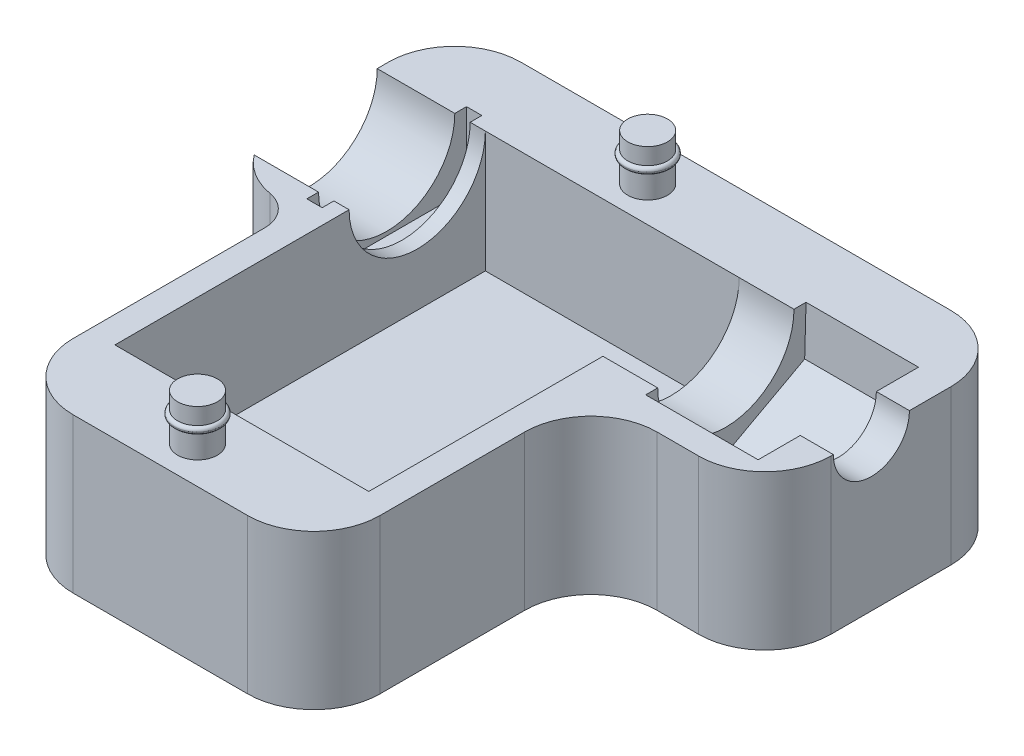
ISO-10303-21;
HEADER;
FILE_DESCRIPTION(('STEP AP214'),'2;1');
FILE_NAME('part.step','',(''),(''),'','','');
FILE_SCHEMA(('AUTOMOTIVE_DESIGN { 1 0 10303 214 1 1 1 1 }'));
ENDSEC;
DATA;
#1=APPLICATION_CONTEXT('core data for automotive mechanical design processes');
#2=APPLICATION_PROTOCOL_DEFINITION('international standard','automotive_design',2000,#1);
#3=PRODUCT_CONTEXT('',#1,'mechanical');
#4=PRODUCT('Part','Part','',(#3));
#5=PRODUCT_RELATED_PRODUCT_CATEGORY('part','',(#4));
#6=PRODUCT_DEFINITION_FORMATION('','',#4);
#7=PRODUCT_DEFINITION_CONTEXT('part definition',#1,'design');
#8=PRODUCT_DEFINITION('design','',#6,#7);
#9=PRODUCT_DEFINITION_SHAPE('','',#8);
#10=(LENGTH_UNIT() NAMED_UNIT(*) SI_UNIT(.MILLI.,.METRE.));
#11=(NAMED_UNIT(*) PLANE_ANGLE_UNIT() SI_UNIT($,.RADIAN.));
#12=(NAMED_UNIT(*) SI_UNIT($,.STERADIAN.) SOLID_ANGLE_UNIT());
#13=UNCERTAINTY_MEASURE_WITH_UNIT(LENGTH_MEASURE(1.E-05),#10,'distance_accuracy_value','');
#14=(GEOMETRIC_REPRESENTATION_CONTEXT(3) GLOBAL_UNCERTAINTY_ASSIGNED_CONTEXT((#13)) GLOBAL_UNIT_ASSIGNED_CONTEXT((#10,
#11,#12)) REPRESENTATION_CONTEXT('',''));
#15=CARTESIAN_POINT('',(0.,0.,0.));
#16=DIRECTION('',(0.,0.,1.));
#17=DIRECTION('',(1.,0.,0.));
#18=AXIS2_PLACEMENT_3D('',#15,#16,#17);
#19=CARTESIAN_POINT('',(-6.96499999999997,40.35,34.4));
#20=DIRECTION('',(0.,-1.,0.));
#21=DIRECTION('',(0.,0.,-1.));
#22=AXIS2_PLACEMENT_3D('',#19,#20,#21);
#23=CYLINDRICAL_SURFACE('',#22,3.);
#24=CARTESIAN_POINT('',(-6.96499999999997,33.35,34.4));
#25=DIRECTION('',(0.,-1.,0.));
#26=DIRECTION('',(0.,0.,-1.));
#27=AXIS2_PLACEMENT_3D('',#24,#25,#26);
#28=CIRCLE('',#27,3.);
#29=CARTESIAN_POINT('',(-6.96499999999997,33.35,31.4));
#30=VERTEX_POINT('',#29);
#31=EDGE_CURVE('E233',#30,#30,#28,.F.);
#32=ORIENTED_EDGE('',*,*,#31,.T.);
#33=EDGE_LOOP('',(#32));
#34=FACE_BOUND('',#33,.T.);
#35=CARTESIAN_POINT('',(-6.96499999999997,36.85,34.4));
#36=DIRECTION('',(0.,1.,0.));
#37=DIRECTION('',(0.,0.,1.));
#38=AXIS2_PLACEMENT_3D('',#35,#36,#37);
#39=CIRCLE('',#38,3.);
#40=CARTESIAN_POINT('',(-6.96499999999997,36.85,37.4));
#41=VERTEX_POINT('',#40);
#42=EDGE_CURVE('E12',#41,#41,#39,.T.);
#43=ORIENTED_EDGE('',*,*,#42,.F.);
#44=EDGE_LOOP('',(#43));
#45=FACE_BOUND('',#44,.T.);
#46=ADVANCED_FACE('F224',(#34,#45),#23,.T.);
#47=CARTESIAN_POINT('',(-6.96499999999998,40.35,-33.65));
#48=DIRECTION('',(0.,-1.,0.));
#49=DIRECTION('',(0.,0.,-1.));
#50=AXIS2_PLACEMENT_3D('',#47,#48,#49);
#51=CYLINDRICAL_SURFACE('',#50,3.);
#52=CARTESIAN_POINT('',(-6.96499999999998,33.35,-33.65));
#53=DIRECTION('',(0.,-1.,0.));
#54=DIRECTION('',(0.,0.,-1.));
#55=AXIS2_PLACEMENT_3D('',#52,#53,#54);
#56=CIRCLE('',#55,3.);
#57=CARTESIAN_POINT('',(-6.96499999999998,33.35,-36.65));
#58=VERTEX_POINT('',#57);
#59=EDGE_CURVE('E512',#58,#58,#56,.F.);
#60=ORIENTED_EDGE('',*,*,#59,.T.);
#61=EDGE_LOOP('',(#60));
#62=FACE_BOUND('',#61,.T.);
#63=CARTESIAN_POINT('',(-6.96499999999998,36.85,-33.65));
#64=DIRECTION('',(0.,1.,0.));
#65=DIRECTION('',(0.,0.,1.));
#66=AXIS2_PLACEMENT_3D('',#63,#64,#65);
#67=CIRCLE('',#66,3.);
#68=CARTESIAN_POINT('',(-6.96499999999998,36.85,-30.65));
#69=VERTEX_POINT('',#68);
#70=EDGE_CURVE('E515',#69,#69,#67,.T.);
#71=ORIENTED_EDGE('',*,*,#70,.F.);
#72=EDGE_LOOP('',(#71));
#73=FACE_BOUND('',#72,.T.);
#74=ADVANCED_FACE('F856',(#62,#73),#51,.T.);
#75=CARTESIAN_POINT('',(42.5,33.35,40.));
#76=DIRECTION('',(-1.,0.,0.));
#77=DIRECTION('',(0.,0.,1.));
#78=AXIS2_PLACEMENT_3D('',#75,#76,#77);
#79=PLANE('',#78);
#80=DIRECTION('',(0.,0.,-1.));
#81=VECTOR('',#80,1.);
#82=CARTESIAN_POINT('',(42.5,10.,45.));
#83=LINE('',#82,#81);
#84=CARTESIAN_POINT('',(42.5,10.,-11.8801725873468));
#85=VERTEX_POINT('',#84);
#86=CARTESIAN_POINT('',(42.5,10.,-30.));
#87=VERTEX_POINT('',#86);
#88=EDGE_CURVE('E452',#85,#87,#83,.T.);
#89=ORIENTED_EDGE('',*,*,#88,.T.);
#90=DIRECTION('',(0.,-1.,0.));
#91=VECTOR('',#90,1.);
#92=CARTESIAN_POINT('',(42.5,33.35,-30.));
#93=LINE('',#92,#91);
#94=CARTESIAN_POINT('',(42.5,33.35,-30.));
#95=VERTEX_POINT('',#94);
#96=EDGE_CURVE('E478',#87,#95,#93,.F.);
#97=ORIENTED_EDGE('',*,*,#96,.T.);
#98=DIRECTION('',(0.,0.,-1.));
#99=VECTOR('',#98,1.);
#100=CARTESIAN_POINT('',(42.5,33.35,40.));
#101=LINE('',#100,#99);
#102=CARTESIAN_POINT('',(42.5,33.35,-23.75));
#103=VERTEX_POINT('',#102);
#104=EDGE_CURVE('E574',#103,#95,#101,.T.);
#105=ORIENTED_EDGE('',*,*,#104,.F.);
#106=CARTESIAN_POINT('',(42.5,33.35,-18.));
#107=DIRECTION('',(1.,0.,0.));
#108=DIRECTION('',(0.,0.,-1.));
#109=AXIS2_PLACEMENT_3D('',#106,#107,#108);
#110=CIRCLE('',#109,5.74999999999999);
#111=CARTESIAN_POINT('',(42.5,33.35,-12.25));
#112=VERTEX_POINT('',#111);
#113=EDGE_CURVE('E712',#112,#103,#110,.T.);
#114=ORIENTED_EDGE('',*,*,#113,.F.);
#115=CARTESIAN_POINT('',(42.5,33.35,-11.8801725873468));
#116=VERTEX_POINT('',#115);
#117=EDGE_CURVE('E477',#116,#112,#101,.T.);
#118=ORIENTED_EDGE('',*,*,#117,.F.);
#119=DIRECTION('',(0.,1.,0.));
#120=VECTOR('',#119,1.);
#121=CARTESIAN_POINT('',(42.5,0.,-11.8801725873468));
#122=LINE('',#121,#120);
#123=EDGE_CURVE('E470',#116,#85,#122,.F.);
#124=ORIENTED_EDGE('',*,*,#123,.T.);
#125=EDGE_LOOP('',(#89,#97,#105,#114,#118,#124));
#126=FACE_BOUND('',#125,.T.);
#127=ADVANCED_FACE('F475',(#126),#79,.F.);
#128=CARTESIAN_POINT('',(-42.5,33.35,-40.));
#129=DIRECTION('',(0.,0.,1.));
#130=DIRECTION('',(1.,0.,0.));
#131=AXIS2_PLACEMENT_3D('',#128,#129,#130);
#132=PLANE('',#131);
#133=DIRECTION('',(1.,0.,0.));
#134=VECTOR('',#133,1.);
#135=CARTESIAN_POINT('',(-42.5,10.,-40.));
#136=LINE('',#135,#134);
#137=CARTESIAN_POINT('',(-32.5,10.,-40.));
#138=VERTEX_POINT('',#137);
#139=CARTESIAN_POINT('',(32.5,10.,-40.));
#140=VERTEX_POINT('',#139);
#141=EDGE_CURVE('E584',#138,#140,#136,.T.);
#142=ORIENTED_EDGE('',*,*,#141,.F.);
#143=DIRECTION('',(0.,-1.,0.));
#144=VECTOR('',#143,1.);
#145=CARTESIAN_POINT('',(-32.5,33.35,-40.));
#146=LINE('',#145,#144);
#147=CARTESIAN_POINT('',(-32.5,33.35,-40.));
#148=VERTEX_POINT('',#147);
#149=EDGE_CURVE('E559',#138,#148,#146,.F.);
#150=ORIENTED_EDGE('',*,*,#149,.T.);
#151=DIRECTION('',(-1.,0.,0.));
#152=VECTOR('',#151,1.);
#153=CARTESIAN_POINT('',(-42.5,33.35,-40.));
#154=LINE('',#153,#152);
#155=CARTESIAN_POINT('',(32.5,33.35,-40.));
#156=VERTEX_POINT('',#155);
#157=EDGE_CURVE('E570',#156,#148,#154,.T.);
#158=ORIENTED_EDGE('',*,*,#157,.F.);
#159=DIRECTION('',(0.,-1.,0.));
#160=VECTOR('',#159,1.);
#161=CARTESIAN_POINT('',(32.5,33.35,-40.));
#162=LINE('',#161,#160);
#163=EDGE_CURVE('E555',#156,#140,#162,.T.);
#164=ORIENTED_EDGE('',*,*,#163,.T.);
#165=EDGE_LOOP('',(#142,#150,#158,#164));
#166=FACE_BOUND('',#165,.T.);
#167=ADVANCED_FACE('F579',(#166),#132,.F.);
#168=CARTESIAN_POINT('',(-42.5,33.35,40.));
#169=DIRECTION('',(1.,0.,0.));
#170=DIRECTION('',(0.,0.,-1.));
#171=AXIS2_PLACEMENT_3D('',#168,#169,#170);
#172=PLANE('',#171);
#173=DIRECTION('',(0.,0.,-1.));
#174=VECTOR('',#173,1.);
#175=CARTESIAN_POINT('',(-42.5,10.,45.));
#176=LINE('',#175,#174);
#177=CARTESIAN_POINT('',(-42.5,10.,-13.7));
#178=VERTEX_POINT('',#177);
#179=CARTESIAN_POINT('',(-42.5,10.,-30.));
#180=VERTEX_POINT('',#179);
#181=EDGE_CURVE('E462',#178,#180,#176,.T.);
#182=ORIENTED_EDGE('',*,*,#181,.F.);
#183=DIRECTION('',(0.,1.,0.));
#184=VECTOR('',#183,1.);
#185=CARTESIAN_POINT('',(-42.5,33.35,-13.7));
#186=LINE('',#185,#184);
#187=CARTESIAN_POINT('',(-42.5,23.9905128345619,-13.7));
#188=VERTEX_POINT('',#187);
#189=EDGE_CURVE('E752',#178,#188,#186,.T.);
#190=ORIENTED_EDGE('',*,*,#189,.T.);
#191=CARTESIAN_POINT('',(-42.5,33.35,-18.));
#192=DIRECTION('',(1.,0.,0.));
#193=DIRECTION('',(0.,0.,-1.));
#194=AXIS2_PLACEMENT_3D('',#191,#192,#193);
#195=CIRCLE('',#194,10.3);
#196=CARTESIAN_POINT('',(-42.5,33.35,-28.3));
#197=VERTEX_POINT('',#196);
#198=EDGE_CURVE('E545',#188,#197,#195,.T.);
#199=ORIENTED_EDGE('',*,*,#198,.T.);
#200=DIRECTION('',(0.,0.,1.));
#201=VECTOR('',#200,1.);
#202=CARTESIAN_POINT('',(-42.5,33.35,40.));
#203=LINE('',#202,#201);
#204=CARTESIAN_POINT('',(-42.5,33.35,-30.));
#205=VERTEX_POINT('',#204);
#206=EDGE_CURVE('E581',#205,#197,#203,.T.);
#207=ORIENTED_EDGE('',*,*,#206,.F.);
#208=DIRECTION('',(0.,-1.,0.));
#209=VECTOR('',#208,1.);
#210=CARTESIAN_POINT('',(-42.5,33.35,-30.));
#211=LINE('',#210,#209);
#212=EDGE_CURVE('E749',#205,#180,#211,.T.);
#213=ORIENTED_EDGE('',*,*,#212,.T.);
#214=EDGE_LOOP('',(#182,#190,#199,#207,#213));
#215=FACE_BOUND('',#214,.T.);
#216=ADVANCED_FACE('F849',(#215),#172,.F.);
#217=CARTESIAN_POINT('',(-42.5,33.35,40.));
#218=DIRECTION('',(0.,0.,-1.));
#219=DIRECTION('',(-1.,0.,0.));
#220=AXIS2_PLACEMENT_3D('',#217,#218,#219);
#221=PLANE('',#220);
#222=DIRECTION('',(-1.,0.,0.));
#223=VECTOR('',#222,1.);
#224=CARTESIAN_POINT('',(-42.5,10.,40.));
#225=LINE('',#224,#223);
#226=CARTESIAN_POINT('',(6.22000000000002,10.,40.));
#227=VERTEX_POINT('',#226);
#228=CARTESIAN_POINT('',(-20.15,10.,40.));
#229=VERTEX_POINT('',#228);
#230=EDGE_CURVE('E899',#227,#229,#225,.T.);
#231=ORIENTED_EDGE('',*,*,#230,.F.);
#232=DIRECTION('',(0.,1.,0.));
#233=VECTOR('',#232,1.);
#234=CARTESIAN_POINT('',(6.22000000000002,33.35,40.));
#235=LINE('',#234,#233);
#236=CARTESIAN_POINT('',(6.22000000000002,33.35,40.));
#237=VERTEX_POINT('',#236);
#238=EDGE_CURVE('E498',#227,#237,#235,.T.);
#239=ORIENTED_EDGE('',*,*,#238,.T.);
#240=DIRECTION('',(1.,0.,0.));
#241=VECTOR('',#240,1.);
#242=CARTESIAN_POINT('',(-42.5,33.35,40.));
#243=LINE('',#242,#241);
#244=CARTESIAN_POINT('',(-20.15,33.35,40.));
#245=VERTEX_POINT('',#244);
#246=EDGE_CURVE('E716',#245,#237,#243,.T.);
#247=ORIENTED_EDGE('',*,*,#246,.F.);
#248=DIRECTION('',(0.,1.,0.));
#249=VECTOR('',#248,1.);
#250=CARTESIAN_POINT('',(-20.15,33.35,40.));
#251=LINE('',#250,#249);
#252=EDGE_CURVE('E495',#245,#229,#251,.F.);
#253=ORIENTED_EDGE('',*,*,#252,.T.);
#254=EDGE_LOOP('',(#231,#239,#247,#253));
#255=FACE_BOUND('',#254,.T.);
#256=ADVANCED_FACE('F846',(#255),#221,.F.);
#257=CARTESIAN_POINT('',(16.22,0.,-1.88017258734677));
#258=DIRECTION('',(-1.,0.,0.));
#259=DIRECTION('',(0.,0.,1.));
#260=AXIS2_PLACEMENT_3D('',#257,#258,#259);
#261=PLANE('',#260);
#262=DIRECTION('',(0.,0.,1.));
#263=VECTOR('',#262,1.);
#264=CARTESIAN_POINT('',(16.22,10.,-1.88017258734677));
#265=LINE('',#264,#263);
#266=CARTESIAN_POINT('',(16.22,10.,8.11982741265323));
#267=VERTEX_POINT('',#266);
#268=CARTESIAN_POINT('',(16.22,10.,30.));
#269=VERTEX_POINT('',#268);
#270=EDGE_CURVE('E904',#267,#269,#265,.T.);
#271=ORIENTED_EDGE('',*,*,#270,.F.);
#272=DIRECTION('',(0.,1.,0.));
#273=VECTOR('',#272,1.);
#274=CARTESIAN_POINT('',(16.22,0.,8.11982741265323));
#275=LINE('',#274,#273);
#276=CARTESIAN_POINT('',(16.22,33.35,8.11982741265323));
#277=VERTEX_POINT('',#276);
#278=EDGE_CURVE('E493',#267,#277,#275,.T.);
#279=ORIENTED_EDGE('',*,*,#278,.T.);
#280=DIRECTION('',(0.,0.,1.));
#281=VECTOR('',#280,1.);
#282=CARTESIAN_POINT('',(16.22,33.35,-1.88017258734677));
#283=LINE('',#282,#281);
#284=CARTESIAN_POINT('',(16.22,33.35,30.));
#285=VERTEX_POINT('',#284);
#286=EDGE_CURVE('E594',#277,#285,#283,.T.);
#287=ORIENTED_EDGE('',*,*,#286,.T.);
#288=DIRECTION('',(0.,1.,0.));
#289=VECTOR('',#288,1.);
#290=CARTESIAN_POINT('',(16.22,0.,30.));
#291=LINE('',#290,#289);
#292=EDGE_CURVE('E490',#285,#269,#291,.F.);
#293=ORIENTED_EDGE('',*,*,#292,.T.);
#294=EDGE_LOOP('',(#271,#279,#287,#293));
#295=FACE_BOUND('',#294,.T.);
#296=ADVANCED_FACE('F770',(#295),#261,.F.);
#297=CARTESIAN_POINT('',(16.22,0.,-1.88017258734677));
#298=DIRECTION('',(0.,0.,1.));
#299=DIRECTION('',(1.,0.,0.));
#300=AXIS2_PLACEMENT_3D('',#297,#298,#299);
#301=PLANE('',#300);
#302=DIRECTION('',(0.,1.,0.));
#303=VECTOR('',#302,1.);
#304=CARTESIAN_POINT('',(26.22,0.,-1.88017258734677));
#305=LINE('',#304,#303);
#306=CARTESIAN_POINT('',(26.22,33.35,-1.88017258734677));
#307=VERTEX_POINT('',#306);
#308=CARTESIAN_POINT('',(26.22,10.,-1.88017258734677));
#309=VERTEX_POINT('',#308);
#310=EDGE_CURVE('E481',#307,#309,#305,.F.);
#311=ORIENTED_EDGE('',*,*,#310,.T.);
#312=DIRECTION('',(1.,0.,0.));
#313=VECTOR('',#312,1.);
#314=CARTESIAN_POINT('',(16.22,10.,-1.88017258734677));
#315=LINE('',#314,#313);
#316=CARTESIAN_POINT('',(32.5,10.,-1.88017258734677));
#317=VERTEX_POINT('',#316);
#318=EDGE_CURVE('E472',#309,#317,#315,.T.);
#319=ORIENTED_EDGE('',*,*,#318,.T.);
#320=DIRECTION('',(0.,1.,0.));
#321=VECTOR('',#320,1.);
#322=CARTESIAN_POINT('',(32.5,33.35,-1.88017258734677));
#323=LINE('',#322,#321);
#324=CARTESIAN_POINT('',(32.5,33.35,-1.88017258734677));
#325=VERTEX_POINT('',#324);
#326=EDGE_CURVE('E471',#317,#325,#323,.T.);
#327=ORIENTED_EDGE('',*,*,#326,.T.);
#328=DIRECTION('',(1.,0.,0.));
#329=VECTOR('',#328,1.);
#330=CARTESIAN_POINT('',(16.22,33.35,-1.88017258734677));
#331=LINE('',#330,#329);
#332=EDGE_CURVE('E597',#307,#325,#331,.T.);
#333=ORIENTED_EDGE('',*,*,#332,.F.);
#334=EDGE_LOOP('',(#311,#319,#327,#333));
#335=FACE_BOUND('',#334,.T.);
#336=ADVANCED_FACE('F908',(#335),#301,.T.);
#337=CARTESIAN_POINT('',(-30.15,0.,-3.7));
#338=DIRECTION('',(1.,0.,0.));
#339=DIRECTION('',(0.,0.,-1.));
#340=AXIS2_PLACEMENT_3D('',#337,#338,#339);
#341=PLANE('',#340);
#342=DIRECTION('',(0.,0.,-1.));
#343=VECTOR('',#342,1.);
#344=CARTESIAN_POINT('',(-30.15,10.,-3.7));
#345=LINE('',#344,#343);
#346=CARTESIAN_POINT('',(-30.15,10.,30.));
#347=VERTEX_POINT('',#346);
#348=CARTESIAN_POINT('',(-30.15,10.,1.06406109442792));
#349=VERTEX_POINT('',#348);
#350=EDGE_CURVE('E240',#347,#349,#345,.T.);
#351=ORIENTED_EDGE('',*,*,#350,.F.);
#352=DIRECTION('',(0.,1.,0.));
#353=VECTOR('',#352,1.);
#354=CARTESIAN_POINT('',(-30.15,0.,30.));
#355=LINE('',#354,#353);
#356=CARTESIAN_POINT('',(-30.15,33.35,30.));
#357=VERTEX_POINT('',#356);
#358=EDGE_CURVE('E500',#347,#357,#355,.T.);
#359=ORIENTED_EDGE('',*,*,#358,.T.);
#360=DIRECTION('',(0.,0.,-1.));
#361=VECTOR('',#360,1.);
#362=CARTESIAN_POINT('',(-30.15,33.35,-3.7));
#363=LINE('',#362,#361);
#364=CARTESIAN_POINT('',(-30.15,33.35,1.06406109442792));
#365=VERTEX_POINT('',#364);
#366=EDGE_CURVE('E592',#357,#365,#363,.T.);
#367=ORIENTED_EDGE('',*,*,#366,.T.);
#368=DIRECTION('',(0.,1.,0.));
#369=VECTOR('',#368,1.);
#370=CARTESIAN_POINT('',(-30.15,0.,1.06406109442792));
#371=LINE('',#370,#369);
#372=EDGE_CURVE('E506',#365,#349,#371,.F.);
#373=ORIENTED_EDGE('',*,*,#372,.T.);
#374=EDGE_LOOP('',(#351,#359,#367,#373));
#375=FACE_BOUND('',#374,.T.);
#376=ADVANCED_FACE('F932',(#375),#341,.F.);
#377=CARTESIAN_POINT('',(-32.5,33.35,-13.7));
#378=DIRECTION('',(0.,1.,0.));
#379=DIRECTION('',(0.,0.,1.));
#380=AXIS2_PLACEMENT_3D('',#377,#378,#379);
#381=CYLINDRICAL_SURFACE('',#380,10.);
#382=ORIENTED_EDGE('',*,*,#189,.F.);
#383=CARTESIAN_POINT('',(-32.5,10.,-13.7));
#384=DIRECTION('',(0.,-1.,0.));
#385=DIRECTION('',(0.,0.,-1.));
#386=AXIS2_PLACEMENT_3D('',#383,#384,#385);
#387=CIRCLE('',#386,10.);
#388=CARTESIAN_POINT('',(-34.2666666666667,10.,-3.85729260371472));
#389=VERTEX_POINT('',#388);
#390=EDGE_CURVE('E892',#178,#389,#387,.F.);
#391=ORIENTED_EDGE('',*,*,#390,.T.);
#392=DIRECTION('',(0.,1.,0.));
#393=VECTOR('',#392,1.);
#394=CARTESIAN_POINT('',(-34.2666666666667,33.35,-3.85729260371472));
#395=LINE('',#394,#393);
#396=CARTESIAN_POINT('',(-34.2666666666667,33.35,-3.85729260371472));
#397=VERTEX_POINT('',#396);
#398=EDGE_CURVE('E504',#389,#397,#395,.T.);
#399=ORIENTED_EDGE('',*,*,#398,.T.);
#400=CARTESIAN_POINT('',(-32.5,33.35,-13.7));
#401=DIRECTION('',(0.,-1.,0.));
#402=DIRECTION('',(0.,0.,-1.));
#403=AXIS2_PLACEMENT_3D('',#400,#401,#402);
#404=CIRCLE('',#403,10.);
#405=CARTESIAN_POINT('',(-40.5,33.35,-7.7));
#406=VERTEX_POINT('',#405);
#407=EDGE_CURVE('E539',#406,#397,#404,.F.);
#408=ORIENTED_EDGE('',*,*,#407,.F.);
#409=CARTESIAN_POINT('',(-42.5,23.9905128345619,-13.7));
#410=CARTESIAN_POINT('',(-42.5000015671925,24.0459820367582,-13.5792593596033));
#411=CARTESIAN_POINT('',(-42.4978128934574,24.1037803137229,-13.4596193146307));
#412=CARTESIAN_POINT('',(-42.4893098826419,24.2238851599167,-13.2227992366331));
#413=CARTESIAN_POINT('',(-42.4829962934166,24.2861909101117,-13.1056187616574));
#414=CARTESIAN_POINT('',(-42.4582760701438,24.4794643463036,-12.7584700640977));
#415=CARTESIAN_POINT('',(-42.4340882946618,24.6169712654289,-12.5324966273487));
#416=CARTESIAN_POINT('',(-42.372812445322,24.9066922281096,-12.0950160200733));
#417=CARTESIAN_POINT('',(-42.3358392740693,25.0587668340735,-11.8833994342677));
#418=CARTESIAN_POINT('',(-42.251238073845,25.3773829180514,-11.4735323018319));
#419=CARTESIAN_POINT('',(-42.2036063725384,25.5439293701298,-11.2752863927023));
#420=CARTESIAN_POINT('',(-42.1002995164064,25.8892964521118,-10.894109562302));
#421=CARTESIAN_POINT('',(-42.0446699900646,26.068044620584,-10.7111004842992));
#422=CARTESIAN_POINT('',(-41.9274846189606,26.4375077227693,-10.359811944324));
#423=CARTESIAN_POINT('',(-41.8659293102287,26.6282215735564,-10.1915311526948));
#424=CARTESIAN_POINT('',(-41.6752437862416,27.2185887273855,-9.70813964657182));
#425=CARTESIAN_POINT('',(-41.540436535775,27.6354036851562,-9.41564855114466));
#426=CARTESIAN_POINT('',(-41.3317257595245,28.3208877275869,-9.00652983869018));
#427=CARTESIAN_POINT('',(-41.2564535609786,28.5765956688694,-8.86821725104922));
#428=CARTESIAN_POINT('',(-41.1107799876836,29.1000798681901,-8.61315386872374));
#429=CARTESIAN_POINT('',(-41.0403796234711,29.3678586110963,-8.49640753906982));
#430=CARTESIAN_POINT('',(-40.9084998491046,29.9132377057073,-8.28589569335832));
#431=CARTESIAN_POINT('',(-40.8469885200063,30.1907982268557,-8.19204707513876));
#432=CARTESIAN_POINT('',(-40.7363245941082,30.7551376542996,-8.02789361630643));
#433=CARTESIAN_POINT('',(-40.6871648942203,31.0419111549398,-7.95757523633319));
#434=CARTESIAN_POINT('',(-40.6224389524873,31.496865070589,-7.86668253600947));
#435=CARTESIAN_POINT('',(-40.6015410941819,31.6626663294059,-7.837749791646));
#436=CARTESIAN_POINT('',(-40.5652987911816,31.9960552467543,-7.78798640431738));
#437=CARTESIAN_POINT('',(-40.5499528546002,32.1636424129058,-7.7671535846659));
#438=CARTESIAN_POINT('',(-40.5251764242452,32.5006568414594,-7.73367758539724));
#439=CARTESIAN_POINT('',(-40.5157665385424,32.6700884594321,-7.72106293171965));
#440=CARTESIAN_POINT('',(-40.5031619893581,33.0096761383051,-7.70421666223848));
#441=CARTESIAN_POINT('',(-40.4999702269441,33.1798325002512,-7.69998895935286));
#442=CARTESIAN_POINT('',(-40.5,33.35,-7.7));
#443=B_SPLINE_CURVE_WITH_KNOTS('',3,(#409,#410,#411,#412,#413,#414,#415,#416,#417,#418,#419,
#420,#421,#422,#423,#424,#425,#426,#427,#428,#429,#430,#431,#432,#433,#434,#435,#436,#437,#438,
#439,#440,#441,#442),.UNSPECIFIED.,.F.,.F.,(4,2,2,2,2,2,2,2,2,2,2,2,2,2,2,2,4),(0.,
0.39852430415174,0.796976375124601,1.59257213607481,2.38119609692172,3.17009219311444,
3.95465409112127,4.7391450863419,6.312933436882,7.21303670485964,8.11332611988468,
9.01029783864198,9.90675254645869,10.4152975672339,10.9237058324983,11.4338695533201,
11.9442712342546),.UNSPECIFIED.);
#444=EDGE_CURVE('E551',#188,#406,#443,.T.);
#445=ORIENTED_EDGE('',*,*,#444,.F.);
#446=EDGE_LOOP('',(#382,#391,#399,#408,#445));
#447=FACE_BOUND('',#446,.T.);
#448=ADVANCED_FACE('F550',(#447),#381,.T.);
#449=CARTESIAN_POINT('',(-32.5,33.35,-30.));
#450=DIRECTION('',(0.,-1.,0.));
#451=DIRECTION('',(0.,0.,-1.));
#452=AXIS2_PLACEMENT_3D('',#449,#450,#451);
#453=CYLINDRICAL_SURFACE('',#452,10.);
#454=ORIENTED_EDGE('',*,*,#149,.F.);
#455=CARTESIAN_POINT('',(-32.5,10.,-30.));
#456=DIRECTION('',(0.,-1.,0.));
#457=DIRECTION('',(0.,0.,-1.));
#458=AXIS2_PLACEMENT_3D('',#455,#456,#457);
#459=CIRCLE('',#458,10.);
#460=EDGE_CURVE('E586',#138,#180,#459,.F.);
#461=ORIENTED_EDGE('',*,*,#460,.T.);
#462=ORIENTED_EDGE('',*,*,#212,.F.);
#463=CARTESIAN_POINT('',(-32.5,33.35,-30.));
#464=DIRECTION('',(0.,-1.,0.));
#465=DIRECTION('',(0.,0.,-1.));
#466=AXIS2_PLACEMENT_3D('',#463,#464,#465);
#467=CIRCLE('',#466,10.);
#468=EDGE_CURVE('E479',#148,#205,#467,.F.);
#469=ORIENTED_EDGE('',*,*,#468,.F.);
#470=EDGE_LOOP('',(#454,#461,#462,#469));
#471=FACE_BOUND('',#470,.T.);
#472=ADVANCED_FACE('F941',(#471),#453,.T.);
#473=CARTESIAN_POINT('',(32.5,33.35,-30.));
#474=DIRECTION('',(0.,-1.,0.));
#475=DIRECTION('',(0.,0.,-1.));
#476=AXIS2_PLACEMENT_3D('',#473,#474,#475);
#477=CYLINDRICAL_SURFACE('',#476,10.);
#478=ORIENTED_EDGE('',*,*,#96,.F.);
#479=CARTESIAN_POINT('',(32.5,10.,-30.));
#480=DIRECTION('',(0.,-1.,0.));
#481=DIRECTION('',(0.,0.,-1.));
#482=AXIS2_PLACEMENT_3D('',#479,#480,#481);
#483=CIRCLE('',#482,10.);
#484=EDGE_CURVE('E458',#87,#140,#483,.F.);
#485=ORIENTED_EDGE('',*,*,#484,.T.);
#486=ORIENTED_EDGE('',*,*,#163,.F.);
#487=CARTESIAN_POINT('',(32.5,33.35,-30.));
#488=DIRECTION('',(0.,-1.,0.));
#489=DIRECTION('',(0.,0.,-1.));
#490=AXIS2_PLACEMENT_3D('',#487,#488,#489);
#491=CIRCLE('',#490,10.);
#492=EDGE_CURVE('E483',#95,#156,#491,.F.);
#493=ORIENTED_EDGE('',*,*,#492,.F.);
#494=EDGE_LOOP('',(#478,#485,#486,#493));
#495=FACE_BOUND('',#494,.T.);
#496=ADVANCED_FACE('F583',(#495),#477,.T.);
#497=CARTESIAN_POINT('',(32.5,0.,-11.8801725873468));
#498=DIRECTION('',(0.,-1.,0.));
#499=DIRECTION('',(0.,0.,-1.));
#500=AXIS2_PLACEMENT_3D('',#497,#498,#499);
#501=CYLINDRICAL_SURFACE('',#500,10.);
#502=ORIENTED_EDGE('',*,*,#326,.F.);
#503=CARTESIAN_POINT('',(32.5,10.,-11.8801725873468));
#504=DIRECTION('',(0.,-1.,0.));
#505=DIRECTION('',(0.,0.,-1.));
#506=AXIS2_PLACEMENT_3D('',#503,#504,#505);
#507=CIRCLE('',#506,10.);
#508=EDGE_CURVE('E455',#317,#85,#507,.F.);
#509=ORIENTED_EDGE('',*,*,#508,.T.);
#510=ORIENTED_EDGE('',*,*,#123,.F.);
#511=CARTESIAN_POINT('',(32.5,33.35,-11.8801725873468));
#512=DIRECTION('',(0.,-1.,0.));
#513=DIRECTION('',(0.,0.,-1.));
#514=AXIS2_PLACEMENT_3D('',#511,#512,#513);
#515=CIRCLE('',#514,10.);
#516=EDGE_CURVE('E556',#325,#116,#515,.F.);
#517=ORIENTED_EDGE('',*,*,#516,.F.);
#518=EDGE_LOOP('',(#502,#509,#510,#517));
#519=FACE_BOUND('',#518,.T.);
#520=ADVANCED_FACE('F468',(#519),#501,.T.);
#521=CARTESIAN_POINT('',(26.22,0.,8.11982741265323));
#522=DIRECTION('',(0.,1.,0.));
#523=DIRECTION('',(0.,0.,1.));
#524=AXIS2_PLACEMENT_3D('',#521,#522,#523);
#525=CYLINDRICAL_SURFACE('',#524,10.);
#526=CARTESIAN_POINT('',(26.22,10.,8.11982741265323));
#527=DIRECTION('',(0.,-1.,0.));
#528=DIRECTION('',(0.,0.,-1.));
#529=AXIS2_PLACEMENT_3D('',#526,#527,#528);
#530=CIRCLE('',#529,10.);
#531=EDGE_CURVE('E906',#309,#267,#530,.F.);
#532=ORIENTED_EDGE('',*,*,#531,.F.);
#533=ORIENTED_EDGE('',*,*,#310,.F.);
#534=CARTESIAN_POINT('',(26.22,33.35,8.11982741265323));
#535=DIRECTION('',(0.,-1.,0.));
#536=DIRECTION('',(0.,0.,-1.));
#537=AXIS2_PLACEMENT_3D('',#534,#535,#536);
#538=CIRCLE('',#537,10.);
#539=EDGE_CURVE('E502',#277,#307,#538,.T.);
#540=ORIENTED_EDGE('',*,*,#539,.F.);
#541=ORIENTED_EDGE('',*,*,#278,.F.);
#542=EDGE_LOOP('',(#532,#533,#540,#541));
#543=FACE_BOUND('',#542,.T.);
#544=ADVANCED_FACE('F915',(#543),#525,.F.);
#545=CARTESIAN_POINT('',(6.22000000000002,33.35,30.));
#546=DIRECTION('',(0.,1.,0.));
#547=DIRECTION('',(0.,0.,1.));
#548=AXIS2_PLACEMENT_3D('',#545,#546,#547);
#549=CYLINDRICAL_SURFACE('',#548,10.);
#550=ORIENTED_EDGE('',*,*,#238,.F.);
#551=CARTESIAN_POINT('',(6.22000000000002,10.,30.));
#552=DIRECTION('',(0.,-1.,0.));
#553=DIRECTION('',(0.,0.,-1.));
#554=AXIS2_PLACEMENT_3D('',#551,#552,#553);
#555=CIRCLE('',#554,10.);
#556=EDGE_CURVE('E901',#227,#269,#555,.F.);
#557=ORIENTED_EDGE('',*,*,#556,.T.);
#558=ORIENTED_EDGE('',*,*,#292,.F.);
#559=CARTESIAN_POINT('',(6.22000000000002,33.35,30.));
#560=DIRECTION('',(0.,-1.,0.));
#561=DIRECTION('',(0.,0.,-1.));
#562=AXIS2_PLACEMENT_3D('',#559,#560,#561);
#563=CIRCLE('',#562,10.);
#564=EDGE_CURVE('E561',#237,#285,#563,.F.);
#565=ORIENTED_EDGE('',*,*,#564,.F.);
#566=EDGE_LOOP('',(#550,#557,#558,#565));
#567=FACE_BOUND('',#566,.T.);
#568=ADVANCED_FACE('F923',(#567),#549,.T.);
#569=CARTESIAN_POINT('',(-20.15,0.,30.));
#570=DIRECTION('',(0.,1.,0.));
#571=DIRECTION('',(0.,0.,1.));
#572=AXIS2_PLACEMENT_3D('',#569,#570,#571);
#573=CYLINDRICAL_SURFACE('',#572,10.);
#574=ORIENTED_EDGE('',*,*,#358,.F.);
#575=CARTESIAN_POINT('',(-20.15,10.,30.));
#576=DIRECTION('',(0.,-1.,0.));
#577=DIRECTION('',(0.,0.,-1.));
#578=AXIS2_PLACEMENT_3D('',#575,#576,#577);
#579=CIRCLE('',#578,10.);
#580=EDGE_CURVE('E896',#347,#229,#579,.F.);
#581=ORIENTED_EDGE('',*,*,#580,.T.);
#582=ORIENTED_EDGE('',*,*,#252,.F.);
#583=CARTESIAN_POINT('',(-20.15,33.35,30.));
#584=DIRECTION('',(0.,-1.,0.));
#585=DIRECTION('',(0.,0.,-1.));
#586=AXIS2_PLACEMENT_3D('',#583,#584,#585);
#587=CIRCLE('',#586,10.);
#588=EDGE_CURVE('E760',#357,#245,#587,.F.);
#589=ORIENTED_EDGE('',*,*,#588,.F.);
#590=EDGE_LOOP('',(#574,#581,#582,#589));
#591=FACE_BOUND('',#590,.T.);
#592=ADVANCED_FACE('F929',(#591),#573,.T.);
#593=CARTESIAN_POINT('',(-35.15,33.35,1.06406109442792));
#594=DIRECTION('',(0.,1.,0.));
#595=DIRECTION('',(0.,0.,1.));
#596=AXIS2_PLACEMENT_3D('',#593,#594,#595);
#597=CYLINDRICAL_SURFACE('',#596,5.);
#598=CARTESIAN_POINT('',(-35.15,10.,1.06406109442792));
#599=DIRECTION('',(0.,-1.,0.));
#600=DIRECTION('',(0.,0.,-1.));
#601=AXIS2_PLACEMENT_3D('',#598,#599,#600);
#602=CIRCLE('',#601,5.);
#603=EDGE_CURVE('E510',#349,#389,#602,.F.);
#604=ORIENTED_EDGE('',*,*,#603,.F.);
#605=ORIENTED_EDGE('',*,*,#372,.F.);
#606=CARTESIAN_POINT('',(-35.15,33.35,1.06406109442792));
#607=DIRECTION('',(0.,-1.,0.));
#608=DIRECTION('',(0.,0.,-1.));
#609=AXIS2_PLACEMENT_3D('',#606,#607,#608);
#610=CIRCLE('',#609,5.);
#611=EDGE_CURVE('E248',#397,#365,#610,.T.);
#612=ORIENTED_EDGE('',*,*,#611,.F.);
#613=ORIENTED_EDGE('',*,*,#398,.F.);
#614=EDGE_LOOP('',(#604,#605,#612,#613));
#615=FACE_BOUND('',#614,.T.);
#616=ADVANCED_FACE('F935',(#615),#597,.F.);
#617=CARTESIAN_POINT('',(0.,33.35,0.));
#618=DIRECTION('',(0.,-1.,0.));
#619=DIRECTION('',(0.,0.,-1.));
#620=AXIS2_PLACEMENT_3D('',#617,#618,#619);
#621=PLANE('',#620);
#622=ORIENTED_EDGE('',*,*,#59,.F.);
#623=EDGE_LOOP('',(#622));
#624=FACE_BOUND('',#623,.T.);
#625=ORIENTED_EDGE('',*,*,#157,.T.);
#626=ORIENTED_EDGE('',*,*,#468,.T.);
#627=ORIENTED_EDGE('',*,*,#206,.T.);
#628=DIRECTION('',(1.,0.,0.));
#629=VECTOR('',#628,1.);
#630=CARTESIAN_POINT('',(-42.5,33.35,-28.3));
#631=LINE('',#630,#629);
#632=CARTESIAN_POINT('',(-30.77,33.35,-28.3));
#633=VERTEX_POINT('',#632);
#634=EDGE_CURVE('E544',#197,#633,#631,.T.);
#635=ORIENTED_EDGE('',*,*,#634,.T.);
#636=DIRECTION('',(0.,0.,1.));
#637=VECTOR('',#636,1.);
#638=CARTESIAN_POINT('',(-30.77,33.35,0.));
#639=LINE('',#638,#637);
#640=CARTESIAN_POINT('',(-30.77,33.35,-30.07));
#641=VERTEX_POINT('',#640);
#642=EDGE_CURVE('E741',#641,#633,#639,.T.);
#643=ORIENTED_EDGE('',*,*,#642,.F.);
#644=DIRECTION('',(1.,0.,0.));
#645=VECTOR('',#644,1.);
#646=CARTESIAN_POINT('',(0.,33.35,-30.07));
#647=LINE('',#646,#645);
#648=CARTESIAN_POINT('',(-28.45,33.35,-30.07));
#649=VERTEX_POINT('',#648);
#650=EDGE_CURVE('E744',#641,#649,#647,.T.);
#651=ORIENTED_EDGE('',*,*,#650,.T.);
#652=DIRECTION('',(0.,0.,1.));
#653=VECTOR('',#652,1.);
#654=CARTESIAN_POINT('',(-28.45,33.35,0.));
#655=LINE('',#654,#653);
#656=CARTESIAN_POINT('',(-28.45,33.35,-28.3));
#657=VERTEX_POINT('',#656);
#658=EDGE_CURVE('E628',#649,#657,#655,.T.);
#659=ORIENTED_EDGE('',*,*,#658,.T.);
#660=DIRECTION('',(1.,0.,0.));
#661=VECTOR('',#660,1.);
#662=CARTESIAN_POINT('',(-28.45,33.35,-28.3));
#663=LINE('',#662,#661);
#664=CARTESIAN_POINT('',(-26.15,33.35,-28.3));
#665=VERTEX_POINT('',#664);
#666=EDGE_CURVE('E634',#657,#665,#663,.T.);
#667=ORIENTED_EDGE('',*,*,#666,.T.);
#668=DIRECTION('',(-1.,0.,0.));
#669=VECTOR('',#668,1.);
#670=CARTESIAN_POINT('',(12.22,33.35,-28.3));
#671=LINE('',#670,#669);
#672=CARTESIAN_POINT('',(12.22,33.35,-28.3));
#673=VERTEX_POINT('',#672);
#674=EDGE_CURVE('E637',#673,#665,#671,.T.);
#675=ORIENTED_EDGE('',*,*,#674,.F.);
#676=DIRECTION('',(1.,0.,0.));
#677=VECTOR('',#676,1.);
#678=CARTESIAN_POINT('',(12.22,33.35,-28.3));
#679=LINE('',#678,#677);
#680=CARTESIAN_POINT('',(20.5,33.35,-28.3));
#681=VERTEX_POINT('',#680);
#682=EDGE_CURVE('E674',#673,#681,#679,.T.);
#683=ORIENTED_EDGE('',*,*,#682,.T.);
#684=DIRECTION('',(0.,0.,1.));
#685=VECTOR('',#684,1.);
#686=CARTESIAN_POINT('',(20.5,33.35,0.));
#687=LINE('',#686,#685);
#688=CARTESIAN_POINT('',(20.5,33.35,-30.1198274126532));
#689=VERTEX_POINT('',#688);
#690=EDGE_CURVE('E728',#689,#681,#687,.T.);
#691=ORIENTED_EDGE('',*,*,#690,.F.);
#692=DIRECTION('',(1.,0.,0.));
#693=VECTOR('',#692,1.);
#694=CARTESIAN_POINT('',(0.,33.35,-30.1198274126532));
#695=LINE('',#694,#693);
#696=CARTESIAN_POINT('',(37.5,33.35,-30.1198274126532));
#697=VERTEX_POINT('',#696);
#698=EDGE_CURVE('E731',#689,#697,#695,.T.);
#699=ORIENTED_EDGE('',*,*,#698,.T.);
#700=DIRECTION('',(0.,0.,1.));
#701=VECTOR('',#700,1.);
#702=CARTESIAN_POINT('',(37.5,33.35,0.));
#703=LINE('',#702,#701);
#704=CARTESIAN_POINT('',(37.5,33.35,-23.75));
#705=VERTEX_POINT('',#704);
#706=EDGE_CURVE('E709',#697,#705,#703,.T.);
#707=ORIENTED_EDGE('',*,*,#706,.T.);
#708=DIRECTION('',(1.,0.,0.));
#709=VECTOR('',#708,1.);
#710=CARTESIAN_POINT('',(37.5,33.35,-23.75));
#711=LINE('',#710,#709);
#712=EDGE_CURVE('E722',#705,#103,#711,.T.);
#713=ORIENTED_EDGE('',*,*,#712,.T.);
#714=ORIENTED_EDGE('',*,*,#104,.T.);
#715=ORIENTED_EDGE('',*,*,#492,.T.);
#716=EDGE_LOOP('',(#625,#626,#627,#635,#643,#651,#659,#667,#675,#683,#691,#699,#707,#713,#714,#715));
#717=FACE_BOUND('',#716,.T.);
#718=ADVANCED_FACE('F533',(#624,#717),#621,.F.);
#719=ORIENTED_EDGE('',*,*,#31,.F.);
#720=EDGE_LOOP('',(#719));
#721=FACE_BOUND('',#720,.T.);
#722=DIRECTION('',(1.,0.,0.));
#723=VECTOR('',#722,1.);
#724=CARTESIAN_POINT('',(-42.5,33.35,-7.7));
#725=LINE('',#724,#723);
#726=CARTESIAN_POINT('',(-30.77,33.35,-7.7));
#727=VERTEX_POINT('',#726);
#728=EDGE_CURVE('E537',#727,#406,#725,.F.);
#729=ORIENTED_EDGE('',*,*,#728,.T.);
#730=ORIENTED_EDGE('',*,*,#407,.T.);
#731=ORIENTED_EDGE('',*,*,#611,.T.);
#732=ORIENTED_EDGE('',*,*,#366,.F.);
#733=ORIENTED_EDGE('',*,*,#588,.T.);
#734=ORIENTED_EDGE('',*,*,#246,.T.);
#735=ORIENTED_EDGE('',*,*,#564,.T.);
#736=ORIENTED_EDGE('',*,*,#286,.F.);
#737=ORIENTED_EDGE('',*,*,#539,.T.);
#738=ORIENTED_EDGE('',*,*,#332,.T.);
#739=ORIENTED_EDGE('',*,*,#516,.T.);
#740=ORIENTED_EDGE('',*,*,#117,.T.);
#741=DIRECTION('',(1.,0.,0.));
#742=VECTOR('',#741,1.);
#743=CARTESIAN_POINT('',(37.5,33.35,-12.25));
#744=LINE('',#743,#742);
#745=CARTESIAN_POINT('',(37.5,33.35,-12.25));
#746=VERTEX_POINT('',#745);
#747=EDGE_CURVE('E719',#112,#746,#744,.F.);
#748=ORIENTED_EDGE('',*,*,#747,.T.);
#749=CARTESIAN_POINT('',(37.5,33.35,-5.88017258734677));
#750=VERTEX_POINT('',#749);
#751=EDGE_CURVE('E702',#746,#750,#703,.T.);
#752=ORIENTED_EDGE('',*,*,#751,.T.);
#753=DIRECTION('',(-1.,0.,0.));
#754=VECTOR('',#753,1.);
#755=CARTESIAN_POINT('',(0.,33.35,-5.88017258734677));
#756=LINE('',#755,#754);
#757=CARTESIAN_POINT('',(20.5,33.35,-5.88017258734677));
#758=VERTEX_POINT('',#757);
#759=EDGE_CURVE('E724',#750,#758,#756,.T.);
#760=ORIENTED_EDGE('',*,*,#759,.T.);
#761=CARTESIAN_POINT('',(20.5,33.35,-7.69999999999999));
#762=VERTEX_POINT('',#761);
#763=EDGE_CURVE('E727',#762,#758,#687,.T.);
#764=ORIENTED_EDGE('',*,*,#763,.F.);
#765=DIRECTION('',(1.,0.,0.));
#766=VECTOR('',#765,1.);
#767=CARTESIAN_POINT('',(12.22,33.35,-7.69999999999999));
#768=LINE('',#767,#766);
#769=CARTESIAN_POINT('',(12.22,33.35,-7.69999999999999));
#770=VERTEX_POINT('',#769);
#771=EDGE_CURVE('E671',#762,#770,#768,.F.);
#772=ORIENTED_EDGE('',*,*,#771,.T.);
#773=DIRECTION('',(0.,0.,1.));
#774=VECTOR('',#773,1.);
#775=CARTESIAN_POINT('',(12.22,33.35,-28.3));
#776=LINE('',#775,#774);
#777=CARTESIAN_POINT('',(12.22,33.35,27.7));
#778=VERTEX_POINT('',#777);
#779=EDGE_CURVE('E642',#770,#778,#776,.T.);
#780=ORIENTED_EDGE('',*,*,#779,.T.);
#781=DIRECTION('',(-1.,0.,0.));
#782=VECTOR('',#781,1.);
#783=CARTESIAN_POINT('',(12.22,33.35,27.7));
#784=LINE('',#783,#782);
#785=CARTESIAN_POINT('',(-26.15,33.35,27.7));
#786=VERTEX_POINT('',#785);
#787=EDGE_CURVE('E654',#778,#786,#784,.T.);
#788=ORIENTED_EDGE('',*,*,#787,.T.);
#789=DIRECTION('',(0.,0.,1.));
#790=VECTOR('',#789,1.);
#791=CARTESIAN_POINT('',(-26.15,33.35,-28.3));
#792=LINE('',#791,#790);
#793=CARTESIAN_POINT('',(-26.15,33.35,-7.7));
#794=VERTEX_POINT('',#793);
#795=EDGE_CURVE('E652',#794,#786,#792,.T.);
#796=ORIENTED_EDGE('',*,*,#795,.F.);
#797=DIRECTION('',(1.,0.,0.));
#798=VECTOR('',#797,1.);
#799=CARTESIAN_POINT('',(-28.45,33.35,-7.7));
#800=LINE('',#799,#798);
#801=CARTESIAN_POINT('',(-28.45,33.35,-7.7));
#802=VERTEX_POINT('',#801);
#803=EDGE_CURVE('E631',#794,#802,#800,.F.);
#804=ORIENTED_EDGE('',*,*,#803,.T.);
#805=CARTESIAN_POINT('',(-28.45,33.35,-5.93));
#806=VERTEX_POINT('',#805);
#807=EDGE_CURVE('E623',#802,#806,#655,.T.);
#808=ORIENTED_EDGE('',*,*,#807,.T.);
#809=DIRECTION('',(-1.,0.,0.));
#810=VECTOR('',#809,1.);
#811=CARTESIAN_POINT('',(0.,33.35,-5.93000000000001));
#812=LINE('',#811,#810);
#813=CARTESIAN_POINT('',(-30.77,33.35,-5.93));
#814=VERTEX_POINT('',#813);
#815=EDGE_CURVE('E739',#806,#814,#812,.T.);
#816=ORIENTED_EDGE('',*,*,#815,.T.);
#817=EDGE_CURVE('E541',#727,#814,#639,.T.);
#818=ORIENTED_EDGE('',*,*,#817,.F.);
#819=EDGE_LOOP('',(#729,#730,#731,#732,#733,#734,#735,#736,#737,#738,#739,#740,#748,#752,#760,
#764,#772,#780,#788,#796,#804,#808,#816,#818));
#820=FACE_BOUND('',#819,.T.);
#821=ADVANCED_FACE('F530',(#721,#820),#621,.F.);
#822=CARTESIAN_POINT('',(37.5,33.35,-18.));
#823=DIRECTION('',(1.,0.,0.));
#824=DIRECTION('',(0.,0.,-1.));
#825=AXIS2_PLACEMENT_3D('',#822,#823,#824);
#826=CYLINDRICAL_SURFACE('',#825,5.74999999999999);
#827=CARTESIAN_POINT('',(37.5,33.35,-18.));
#828=DIRECTION('',(1.,0.,0.));
#829=DIRECTION('',(0.,0.,-1.));
#830=AXIS2_PLACEMENT_3D('',#827,#828,#829);
#831=CIRCLE('',#830,5.74999999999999);
#832=EDGE_CURVE('E710',#746,#705,#831,.T.);
#833=ORIENTED_EDGE('',*,*,#832,.F.);
#834=ORIENTED_EDGE('',*,*,#747,.F.);
#835=ORIENTED_EDGE('',*,*,#113,.T.);
#836=ORIENTED_EDGE('',*,*,#712,.F.);
#837=EDGE_LOOP('',(#833,#834,#835,#836));
#838=FACE_BOUND('',#837,.T.);
#839=ADVANCED_FACE('F532',(#838),#826,.F.);
#840=CARTESIAN_POINT('',(20.5,26.0227552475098,-29.9170115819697));
#841=DIRECTION('',(0.,-0.0276690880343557,-0.999617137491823));
#842=DIRECTION('',(0.,0.999617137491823,-0.0276690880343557));
#843=AXIS2_PLACEMENT_3D('',#840,#841,#842);
#844=PLANE('',#843);
#845=DIRECTION('',(0.,0.999617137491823,-0.0276690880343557));
#846=VECTOR('',#845,1.);
#847=CARTESIAN_POINT('',(20.5,26.0227552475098,-29.9170115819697));
#848=LINE('',#847,#846);
#849=CARTESIAN_POINT('',(20.5,26.0227552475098,-29.9170115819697));
#850=VERTEX_POINT('',#849);
#851=EDGE_CURVE('E678',#850,#689,#848,.T.);
#852=ORIENTED_EDGE('',*,*,#851,.F.);
#853=DIRECTION('',(1.,0.,0.));
#854=VECTOR('',#853,1.);
#855=CARTESIAN_POINT('',(20.5,26.0227552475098,-29.9170115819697));
#856=LINE('',#855,#854);
#857=CARTESIAN_POINT('',(37.5,26.0227552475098,-29.9170115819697));
#858=VERTEX_POINT('',#857);
#859=EDGE_CURVE('E700',#850,#858,#856,.T.);
#860=ORIENTED_EDGE('',*,*,#859,.T.);
#861=DIRECTION('',(0.,0.999617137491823,-0.0276690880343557));
#862=VECTOR('',#861,1.);
#863=CARTESIAN_POINT('',(37.5,26.0227552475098,-29.9170115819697));
#864=LINE('',#863,#862);
#865=EDGE_CURVE('E677',#858,#697,#864,.T.);
#866=ORIENTED_EDGE('',*,*,#865,.T.);
#867=ORIENTED_EDGE('',*,*,#698,.F.);
#868=EDGE_LOOP('',(#852,#860,#866,#867));
#869=FACE_BOUND('',#868,.T.);
#870=ADVANCED_FACE('F838',(#869),#844,.F.);
#871=CARTESIAN_POINT('',(20.5,40.6772447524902,-6.08298841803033));
#872=DIRECTION('',(0.,0.0276690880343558,0.999617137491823));
#873=DIRECTION('',(0.,-0.999617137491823,0.0276690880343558));
#874=AXIS2_PLACEMENT_3D('',#871,#872,#873);
#875=PLANE('',#874);
#876=DIRECTION('',(0.,-0.999617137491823,0.0276690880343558));
#877=VECTOR('',#876,1.);
#878=CARTESIAN_POINT('',(37.5,40.6772447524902,-6.08298841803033));
#879=LINE('',#878,#877);
#880=CARTESIAN_POINT('',(37.5,26.693187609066,-5.69591411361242));
#881=VERTEX_POINT('',#880);
#882=EDGE_CURVE('E693',#750,#881,#879,.T.);
#883=ORIENTED_EDGE('',*,*,#882,.T.);
#884=DIRECTION('',(1.,0.,0.));
#885=VECTOR('',#884,1.);
#886=CARTESIAN_POINT('',(20.5,26.693187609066,-5.69591411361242));
#887=LINE('',#886,#885);
#888=CARTESIAN_POINT('',(20.5,26.693187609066,-5.69591411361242));
#889=VERTEX_POINT('',#888);
#890=EDGE_CURVE('E690',#889,#881,#887,.T.);
#891=ORIENTED_EDGE('',*,*,#890,.F.);
#892=DIRECTION('',(0.,-0.999617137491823,0.0276690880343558));
#893=VECTOR('',#892,1.);
#894=CARTESIAN_POINT('',(20.5,40.6772447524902,-6.08298841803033));
#895=LINE('',#894,#893);
#896=EDGE_CURVE('E681',#758,#889,#895,.T.);
#897=ORIENTED_EDGE('',*,*,#896,.F.);
#898=ORIENTED_EDGE('',*,*,#759,.F.);
#899=EDGE_LOOP('',(#883,#891,#897,#898));
#900=FACE_BOUND('',#899,.T.);
#901=ADVANCED_FACE('F824',(#900),#875,.F.);
#902=CARTESIAN_POINT('',(20.5,0.,0.));
#903=DIRECTION('',(1.,0.,0.));
#904=DIRECTION('',(0.,0.,-1.));
#905=AXIS2_PLACEMENT_3D('',#902,#903,#904);
#906=PLANE('',#905);
#907=CARTESIAN_POINT('',(20.5,33.35,-18.));
#908=DIRECTION('',(1.,0.,0.));
#909=DIRECTION('',(0.,0.,-1.));
#910=AXIS2_PLACEMENT_3D('',#907,#908,#909);
#911=CIRCLE('',#910,10.3);
#912=EDGE_CURVE('E734',#762,#681,#911,.T.);
#913=ORIENTED_EDGE('',*,*,#912,.F.);
#914=ORIENTED_EDGE('',*,*,#763,.T.);
#915=ORIENTED_EDGE('',*,*,#896,.T.);
#916=DIRECTION('',(0.,-0.523770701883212,-0.851859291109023));
#917=VECTOR('',#916,1.);
#918=CARTESIAN_POINT('',(20.5,26.693187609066,-5.69591411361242));
#919=LINE('',#918,#917);
#920=CARTESIAN_POINT('',(20.5,19.3659428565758,-17.6129256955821));
#921=VERTEX_POINT('',#920);
#922=EDGE_CURVE('E684',#889,#921,#919,.T.);
#923=ORIENTED_EDGE('',*,*,#922,.T.);
#924=DIRECTION('',(0.,0.475846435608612,-0.879528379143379));
#925=VECTOR('',#924,1.);
#926=CARTESIAN_POINT('',(20.5,19.3659428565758,-17.6129256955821));
#927=LINE('',#926,#925);
#928=EDGE_CURVE('E687',#921,#850,#927,.T.);
#929=ORIENTED_EDGE('',*,*,#928,.T.);
#930=ORIENTED_EDGE('',*,*,#851,.T.);
#931=ORIENTED_EDGE('',*,*,#690,.T.);
#932=EDGE_LOOP('',(#913,#914,#915,#923,#929,#930,#931));
#933=FACE_BOUND('',#932,.T.);
#934=ADVANCED_FACE('F820',(#933),#906,.T.);
#935=CARTESIAN_POINT('',(37.5,0.,0.));
#936=DIRECTION('',(1.,0.,0.));
#937=DIRECTION('',(0.,0.,-1.));
#938=AXIS2_PLACEMENT_3D('',#935,#936,#937);
#939=PLANE('',#938);
#940=ORIENTED_EDGE('',*,*,#865,.F.);
#941=DIRECTION('',(0.,0.475846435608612,-0.879528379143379));
#942=VECTOR('',#941,1.);
#943=CARTESIAN_POINT('',(37.5,19.3659428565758,-17.6129256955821));
#944=LINE('',#943,#942);
#945=CARTESIAN_POINT('',(37.5,19.3659428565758,-17.6129256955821));
#946=VERTEX_POINT('',#945);
#947=EDGE_CURVE('E682',#946,#858,#944,.T.);
#948=ORIENTED_EDGE('',*,*,#947,.F.);
#949=DIRECTION('',(0.,-0.523770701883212,-0.851859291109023));
#950=VECTOR('',#949,1.);
#951=CARTESIAN_POINT('',(37.5,26.693187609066,-5.69591411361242));
#952=LINE('',#951,#950);
#953=EDGE_CURVE('E695',#881,#946,#952,.T.);
#954=ORIENTED_EDGE('',*,*,#953,.F.);
#955=ORIENTED_EDGE('',*,*,#882,.F.);
#956=ORIENTED_EDGE('',*,*,#751,.F.);
#957=ORIENTED_EDGE('',*,*,#832,.T.);
#958=ORIENTED_EDGE('',*,*,#706,.F.);
#959=EDGE_LOOP('',(#940,#948,#954,#955,#956,#957,#958));
#960=FACE_BOUND('',#959,.T.);
#961=ADVANCED_FACE('F823',(#960),#939,.F.);
#962=CARTESIAN_POINT('',(20.5,19.3659428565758,-17.6129256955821));
#963=DIRECTION('',(0.,-0.879528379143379,-0.475846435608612));
#964=DIRECTION('',(0.,0.475846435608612,-0.879528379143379));
#965=AXIS2_PLACEMENT_3D('',#962,#963,#964);
#966=PLANE('',#965);
#967=ORIENTED_EDGE('',*,*,#947,.T.);
#968=ORIENTED_EDGE('',*,*,#859,.F.);
#969=ORIENTED_EDGE('',*,*,#928,.F.);
#970=DIRECTION('',(1.,0.,0.));
#971=VECTOR('',#970,1.);
#972=CARTESIAN_POINT('',(20.5,19.3659428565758,-17.6129256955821));
#973=LINE('',#972,#971);
#974=EDGE_CURVE('E703',#921,#946,#973,.T.);
#975=ORIENTED_EDGE('',*,*,#974,.T.);
#976=EDGE_LOOP('',(#967,#968,#969,#975));
#977=FACE_BOUND('',#976,.T.);
#978=ADVANCED_FACE('F828',(#977),#966,.F.);
#979=CARTESIAN_POINT('',(20.5,26.693187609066,-5.69591411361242));
#980=DIRECTION('',(0.,-0.851859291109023,0.523770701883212));
#981=DIRECTION('',(0.,-0.523770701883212,-0.851859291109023));
#982=AXIS2_PLACEMENT_3D('',#979,#980,#981);
#983=PLANE('',#982);
#984=ORIENTED_EDGE('',*,*,#953,.T.);
#985=ORIENTED_EDGE('',*,*,#974,.F.);
#986=ORIENTED_EDGE('',*,*,#922,.F.);
#987=ORIENTED_EDGE('',*,*,#890,.T.);
#988=EDGE_LOOP('',(#984,#985,#986,#987));
#989=FACE_BOUND('',#988,.T.);
#990=ADVANCED_FACE('F818',(#989),#983,.F.);
#991=CARTESIAN_POINT('',(12.22,33.35,-18.));
#992=DIRECTION('',(1.,0.,0.));
#993=DIRECTION('',(0.,0.,-1.));
#994=AXIS2_PLACEMENT_3D('',#991,#992,#993);
#995=CYLINDRICAL_SURFACE('',#994,10.3);
#996=CARTESIAN_POINT('',(12.22,33.35,-18.));
#997=DIRECTION('',(1.,0.,0.));
#998=DIRECTION('',(0.,0.,-1.));
#999=AXIS2_PLACEMENT_3D('',#996,#997,#998);
#1000=CIRCLE('',#999,10.3);
#1001=EDGE_CURVE('E662',#770,#673,#1000,.T.);
#1002=ORIENTED_EDGE('',*,*,#1001,.F.);
#1003=ORIENTED_EDGE('',*,*,#771,.F.);
#1004=ORIENTED_EDGE('',*,*,#912,.T.);
#1005=ORIENTED_EDGE('',*,*,#682,.F.);
#1006=EDGE_LOOP('',(#1002,#1003,#1004,#1005));
#1007=FACE_BOUND('',#1006,.T.);
#1008=ADVANCED_FACE('F804',(#1007),#995,.F.);
#1009=CARTESIAN_POINT('',(12.22,15.035,-28.3));
#1010=DIRECTION('',(-1.,0.,0.));
#1011=DIRECTION('',(0.,0.,1.));
#1012=AXIS2_PLACEMENT_3D('',#1009,#1010,#1011);
#1013=PLANE('',#1012);
#1014=ORIENTED_EDGE('',*,*,#1001,.T.);
#1015=DIRECTION('',(0.,1.,0.));
#1016=VECTOR('',#1015,1.);
#1017=CARTESIAN_POINT('',(12.22,15.035,-28.3));
#1018=LINE('',#1017,#1016);
#1019=CARTESIAN_POINT('',(12.22,15.035,-28.3));
#1020=VERTEX_POINT('',#1019);
#1021=EDGE_CURVE('E659',#1020,#673,#1018,.T.);
#1022=ORIENTED_EDGE('',*,*,#1021,.F.);
#1023=DIRECTION('',(0.,0.,1.));
#1024=VECTOR('',#1023,1.);
#1025=CARTESIAN_POINT('',(12.22,15.035,-28.3));
#1026=LINE('',#1025,#1024);
#1027=CARTESIAN_POINT('',(12.22,15.035,27.7));
#1028=VERTEX_POINT('',#1027);
#1029=EDGE_CURVE('E647',#1020,#1028,#1026,.T.);
#1030=ORIENTED_EDGE('',*,*,#1029,.T.);
#1031=DIRECTION('',(0.,1.,0.));
#1032=VECTOR('',#1031,1.);
#1033=CARTESIAN_POINT('',(12.22,15.035,27.7));
#1034=LINE('',#1033,#1032);
#1035=EDGE_CURVE('E663',#1028,#778,#1034,.T.);
#1036=ORIENTED_EDGE('',*,*,#1035,.T.);
#1037=ORIENTED_EDGE('',*,*,#779,.F.);
#1038=EDGE_LOOP('',(#1014,#1022,#1030,#1036,#1037));
#1039=FACE_BOUND('',#1038,.T.);
#1040=ADVANCED_FACE('F800',(#1039),#1013,.T.);
#1041=CARTESIAN_POINT('',(12.22,15.035,-28.3));
#1042=DIRECTION('',(0.,0.,-1.));
#1043=DIRECTION('',(-1.,0.,0.));
#1044=AXIS2_PLACEMENT_3D('',#1041,#1042,#1043);
#1045=PLANE('',#1044);
#1046=ORIENTED_EDGE('',*,*,#674,.T.);
#1047=DIRECTION('',(0.,1.,0.));
#1048=VECTOR('',#1047,1.);
#1049=CARTESIAN_POINT('',(-26.15,15.035,-28.3));
#1050=LINE('',#1049,#1048);
#1051=CARTESIAN_POINT('',(-26.15,15.035,-28.3));
#1052=VERTEX_POINT('',#1051);
#1053=EDGE_CURVE('E649',#1052,#665,#1050,.T.);
#1054=ORIENTED_EDGE('',*,*,#1053,.F.);
#1055=DIRECTION('',(-1.,0.,0.));
#1056=VECTOR('',#1055,1.);
#1057=CARTESIAN_POINT('',(12.22,15.035,-28.3));
#1058=LINE('',#1057,#1056);
#1059=EDGE_CURVE('E638',#1020,#1052,#1058,.T.);
#1060=ORIENTED_EDGE('',*,*,#1059,.F.);
#1061=ORIENTED_EDGE('',*,*,#1021,.T.);
#1062=EDGE_LOOP('',(#1046,#1054,#1060,#1061));
#1063=FACE_BOUND('',#1062,.T.);
#1064=ADVANCED_FACE('F803',(#1063),#1045,.F.);
#1065=CARTESIAN_POINT('',(12.22,15.035,27.7));
#1066=DIRECTION('',(0.,0.,-1.));
#1067=DIRECTION('',(-1.,0.,0.));
#1068=AXIS2_PLACEMENT_3D('',#1065,#1066,#1067);
#1069=PLANE('',#1068);
#1070=ORIENTED_EDGE('',*,*,#787,.F.);
#1071=ORIENTED_EDGE('',*,*,#1035,.F.);
#1072=DIRECTION('',(-1.,0.,0.));
#1073=VECTOR('',#1072,1.);
#1074=CARTESIAN_POINT('',(12.22,15.035,27.7));
#1075=LINE('',#1074,#1073);
#1076=CARTESIAN_POINT('',(-26.15,15.035,27.7));
#1077=VERTEX_POINT('',#1076);
#1078=EDGE_CURVE('E645',#1028,#1077,#1075,.T.);
#1079=ORIENTED_EDGE('',*,*,#1078,.T.);
#1080=DIRECTION('',(0.,1.,0.));
#1081=VECTOR('',#1080,1.);
#1082=CARTESIAN_POINT('',(-26.15,15.035,27.7));
#1083=LINE('',#1082,#1081);
#1084=EDGE_CURVE('E665',#1077,#786,#1083,.T.);
#1085=ORIENTED_EDGE('',*,*,#1084,.T.);
#1086=EDGE_LOOP('',(#1070,#1071,#1079,#1085));
#1087=FACE_BOUND('',#1086,.T.);
#1088=ADVANCED_FACE('F806',(#1087),#1069,.T.);
#1089=CARTESIAN_POINT('',(-26.15,15.035,-28.3));
#1090=DIRECTION('',(-1.,0.,0.));
#1091=DIRECTION('',(0.,0.,1.));
#1092=AXIS2_PLACEMENT_3D('',#1089,#1090,#1091);
#1093=PLANE('',#1092);
#1094=ORIENTED_EDGE('',*,*,#1053,.T.);
#1095=CARTESIAN_POINT('',(-26.15,33.35,-18.));
#1096=DIRECTION('',(-1.,0.,0.));
#1097=DIRECTION('',(0.,0.,1.));
#1098=AXIS2_PLACEMENT_3D('',#1095,#1096,#1097);
#1099=CIRCLE('',#1098,10.3);
#1100=EDGE_CURVE('E736',#665,#794,#1099,.T.);
#1101=ORIENTED_EDGE('',*,*,#1100,.T.);
#1102=ORIENTED_EDGE('',*,*,#795,.T.);
#1103=ORIENTED_EDGE('',*,*,#1084,.F.);
#1104=DIRECTION('',(0.,0.,1.));
#1105=VECTOR('',#1104,1.);
#1106=CARTESIAN_POINT('',(-26.15,15.035,-28.3));
#1107=LINE('',#1106,#1105);
#1108=EDGE_CURVE('E641',#1052,#1077,#1107,.T.);
#1109=ORIENTED_EDGE('',*,*,#1108,.F.);
#1110=EDGE_LOOP('',(#1094,#1101,#1102,#1103,#1109));
#1111=FACE_BOUND('',#1110,.T.);
#1112=ADVANCED_FACE('F798',(#1111),#1093,.F.);
#1113=CARTESIAN_POINT('',(0.,15.035,0.));
#1114=DIRECTION('',(0.,1.,0.));
#1115=DIRECTION('',(0.,0.,1.));
#1116=AXIS2_PLACEMENT_3D('',#1113,#1114,#1115);
#1117=PLANE('',#1116);
#1118=ORIENTED_EDGE('',*,*,#1059,.T.);
#1119=ORIENTED_EDGE('',*,*,#1108,.T.);
#1120=ORIENTED_EDGE('',*,*,#1078,.F.);
#1121=ORIENTED_EDGE('',*,*,#1029,.F.);
#1122=EDGE_LOOP('',(#1118,#1119,#1120,#1121));
#1123=FACE_BOUND('',#1122,.T.);
#1124=ADVANCED_FACE('F794',(#1123),#1117,.T.);
#1125=CARTESIAN_POINT('',(-28.45,33.35,-18.));
#1126=DIRECTION('',(1.,0.,0.));
#1127=DIRECTION('',(0.,0.,-1.));
#1128=AXIS2_PLACEMENT_3D('',#1125,#1126,#1127);
#1129=CYLINDRICAL_SURFACE('',#1128,10.3);
#1130=CARTESIAN_POINT('',(-28.45,33.35,-18.));
#1131=DIRECTION('',(1.,0.,0.));
#1132=DIRECTION('',(0.,0.,-1.));
#1133=AXIS2_PLACEMENT_3D('',#1130,#1131,#1132);
#1134=CIRCLE('',#1133,10.3);
#1135=EDGE_CURVE('E629',#802,#657,#1134,.T.);
#1136=ORIENTED_EDGE('',*,*,#1135,.F.);
#1137=ORIENTED_EDGE('',*,*,#803,.F.);
#1138=ORIENTED_EDGE('',*,*,#1100,.F.);
#1139=ORIENTED_EDGE('',*,*,#666,.F.);
#1140=EDGE_LOOP('',(#1136,#1137,#1138,#1139));
#1141=FACE_BOUND('',#1140,.T.);
#1142=ADVANCED_FACE('F790',(#1141),#1129,.F.);
#1143=CARTESIAN_POINT('',(-30.77,22.45,-5.93));
#1144=DIRECTION('',(0.,0.,1.));
#1145=DIRECTION('',(1.,0.,0.));
#1146=AXIS2_PLACEMENT_3D('',#1143,#1144,#1145);
#1147=PLANE('',#1146);
#1148=DIRECTION('',(0.,-1.,0.));
#1149=VECTOR('',#1148,1.);
#1150=CARTESIAN_POINT('',(-28.45,22.45,-5.93));
#1151=LINE('',#1150,#1149);
#1152=CARTESIAN_POINT('',(-28.45,22.45,-5.93));
#1153=VERTEX_POINT('',#1152);
#1154=EDGE_CURVE('E604',#806,#1153,#1151,.T.);
#1155=ORIENTED_EDGE('',*,*,#1154,.T.);
#1156=DIRECTION('',(1.,0.,0.));
#1157=VECTOR('',#1156,1.);
#1158=CARTESIAN_POINT('',(-30.77,22.45,-5.93));
#1159=LINE('',#1158,#1157);
#1160=CARTESIAN_POINT('',(-30.77,22.45,-5.93));
#1161=VERTEX_POINT('',#1160);
#1162=EDGE_CURVE('E614',#1161,#1153,#1159,.T.);
#1163=ORIENTED_EDGE('',*,*,#1162,.F.);
#1164=DIRECTION('',(0.,-1.,0.));
#1165=VECTOR('',#1164,1.);
#1166=CARTESIAN_POINT('',(-30.77,22.45,-5.93));
#1167=LINE('',#1166,#1165);
#1168=EDGE_CURVE('E605',#814,#1161,#1167,.T.);
#1169=ORIENTED_EDGE('',*,*,#1168,.F.);
#1170=ORIENTED_EDGE('',*,*,#815,.F.);
#1171=EDGE_LOOP('',(#1155,#1163,#1169,#1170));
#1172=FACE_BOUND('',#1171,.T.);
#1173=ADVANCED_FACE('F783',(#1172),#1147,.F.);
#1174=CARTESIAN_POINT('',(-30.77,22.45,-30.07));
#1175=DIRECTION('',(0.,0.,-1.));
#1176=DIRECTION('',(-1.,0.,0.));
#1177=AXIS2_PLACEMENT_3D('',#1174,#1175,#1176);
#1178=PLANE('',#1177);
#1179=DIRECTION('',(0.,1.,0.));
#1180=VECTOR('',#1179,1.);
#1181=CARTESIAN_POINT('',(-30.77,22.45,-30.07));
#1182=LINE('',#1181,#1180);
#1183=CARTESIAN_POINT('',(-30.77,22.45,-30.07));
#1184=VERTEX_POINT('',#1183);
#1185=EDGE_CURVE('E611',#1184,#641,#1182,.T.);
#1186=ORIENTED_EDGE('',*,*,#1185,.F.);
#1187=DIRECTION('',(1.,0.,0.));
#1188=VECTOR('',#1187,1.);
#1189=CARTESIAN_POINT('',(-30.77,22.45,-30.07));
#1190=LINE('',#1189,#1188);
#1191=CARTESIAN_POINT('',(-28.45,22.45,-30.07));
#1192=VERTEX_POINT('',#1191);
#1193=EDGE_CURVE('E621',#1184,#1192,#1190,.T.);
#1194=ORIENTED_EDGE('',*,*,#1193,.T.);
#1195=DIRECTION('',(0.,1.,0.));
#1196=VECTOR('',#1195,1.);
#1197=CARTESIAN_POINT('',(-28.45,22.45,-30.07));
#1198=LINE('',#1197,#1196);
#1199=EDGE_CURVE('E608',#1192,#649,#1198,.T.);
#1200=ORIENTED_EDGE('',*,*,#1199,.T.);
#1201=ORIENTED_EDGE('',*,*,#650,.F.);
#1202=EDGE_LOOP('',(#1186,#1194,#1200,#1201));
#1203=FACE_BOUND('',#1202,.T.);
#1204=ADVANCED_FACE('F776',(#1203),#1178,.F.);
#1205=CARTESIAN_POINT('',(-30.77,0.,0.));
#1206=DIRECTION('',(1.,0.,0.));
#1207=DIRECTION('',(0.,0.,-1.));
#1208=AXIS2_PLACEMENT_3D('',#1205,#1206,#1207);
#1209=PLANE('',#1208);
#1210=CARTESIAN_POINT('',(-30.77,33.35,-18.));
#1211=DIRECTION('',(1.,0.,0.));
#1212=DIRECTION('',(0.,0.,-1.));
#1213=AXIS2_PLACEMENT_3D('',#1210,#1211,#1212);
#1214=CIRCLE('',#1213,10.3);
#1215=EDGE_CURVE('E747',#727,#633,#1214,.T.);
#1216=ORIENTED_EDGE('',*,*,#1215,.F.);
#1217=ORIENTED_EDGE('',*,*,#817,.T.);
#1218=ORIENTED_EDGE('',*,*,#1168,.T.);
#1219=DIRECTION('',(0.,0.,-1.));
#1220=VECTOR('',#1219,1.);
#1221=CARTESIAN_POINT('',(-30.77,22.45,-30.07));
#1222=LINE('',#1221,#1220);
#1223=EDGE_CURVE('E607',#1161,#1184,#1222,.T.);
#1224=ORIENTED_EDGE('',*,*,#1223,.T.);
#1225=ORIENTED_EDGE('',*,*,#1185,.T.);
#1226=ORIENTED_EDGE('',*,*,#642,.T.);
#1227=EDGE_LOOP('',(#1216,#1217,#1218,#1224,#1225,#1226));
#1228=FACE_BOUND('',#1227,.T.);
#1229=ADVANCED_FACE('F772',(#1228),#1209,.T.);
#1230=CARTESIAN_POINT('',(-28.45,0.,0.));
#1231=DIRECTION('',(1.,0.,0.));
#1232=DIRECTION('',(0.,0.,-1.));
#1233=AXIS2_PLACEMENT_3D('',#1230,#1231,#1232);
#1234=PLANE('',#1233);
#1235=ORIENTED_EDGE('',*,*,#1199,.F.);
#1236=DIRECTION('',(0.,0.,-1.));
#1237=VECTOR('',#1236,1.);
#1238=CARTESIAN_POINT('',(-28.45,22.45,-30.07));
#1239=LINE('',#1238,#1237);
#1240=EDGE_CURVE('E616',#1153,#1192,#1239,.T.);
#1241=ORIENTED_EDGE('',*,*,#1240,.F.);
#1242=ORIENTED_EDGE('',*,*,#1154,.F.);
#1243=ORIENTED_EDGE('',*,*,#807,.F.);
#1244=ORIENTED_EDGE('',*,*,#1135,.T.);
#1245=ORIENTED_EDGE('',*,*,#658,.F.);
#1246=EDGE_LOOP('',(#1235,#1241,#1242,#1243,#1244,#1245));
#1247=FACE_BOUND('',#1246,.T.);
#1248=ADVANCED_FACE('F775',(#1247),#1234,.F.);
#1249=CARTESIAN_POINT('',(-30.77,22.45,-30.07));
#1250=DIRECTION('',(0.,-1.,0.));
#1251=DIRECTION('',(0.,0.,-1.));
#1252=AXIS2_PLACEMENT_3D('',#1249,#1250,#1251);
#1253=PLANE('',#1252);
#1254=ORIENTED_EDGE('',*,*,#1240,.T.);
#1255=ORIENTED_EDGE('',*,*,#1193,.F.);
#1256=ORIENTED_EDGE('',*,*,#1223,.F.);
#1257=ORIENTED_EDGE('',*,*,#1162,.T.);
#1258=EDGE_LOOP('',(#1254,#1255,#1256,#1257));
#1259=FACE_BOUND('',#1258,.T.);
#1260=ADVANCED_FACE('F769',(#1259),#1253,.F.);
#1261=CARTESIAN_POINT('',(-42.5,33.35,-18.));
#1262=DIRECTION('',(1.,0.,0.));
#1263=DIRECTION('',(0.,0.,-1.));
#1264=AXIS2_PLACEMENT_3D('',#1261,#1262,#1263);
#1265=CYLINDRICAL_SURFACE('',#1264,10.3);
#1266=ORIENTED_EDGE('',*,*,#198,.F.);
#1267=ORIENTED_EDGE('',*,*,#444,.T.);
#1268=ORIENTED_EDGE('',*,*,#728,.F.);
#1269=ORIENTED_EDGE('',*,*,#1215,.T.);
#1270=ORIENTED_EDGE('',*,*,#634,.F.);
#1271=EDGE_LOOP('',(#1266,#1267,#1268,#1269,#1270));
#1272=FACE_BOUND('',#1271,.T.);
#1273=ADVANCED_FACE('F764',(#1272),#1265,.F.);
#1274=CARTESIAN_POINT('',(-42.5,10.,45.));
#1275=DIRECTION('',(0.,-1.,0.));
#1276=DIRECTION('',(0.,0.,-1.));
#1277=AXIS2_PLACEMENT_3D('',#1274,#1275,#1276);
#1278=PLANE('',#1277);
#1279=ORIENTED_EDGE('',*,*,#141,.T.);
#1280=ORIENTED_EDGE('',*,*,#484,.F.);
#1281=ORIENTED_EDGE('',*,*,#88,.F.);
#1282=ORIENTED_EDGE('',*,*,#508,.F.);
#1283=ORIENTED_EDGE('',*,*,#318,.F.);
#1284=ORIENTED_EDGE('',*,*,#531,.T.);
#1285=ORIENTED_EDGE('',*,*,#270,.T.);
#1286=ORIENTED_EDGE('',*,*,#556,.F.);
#1287=ORIENTED_EDGE('',*,*,#230,.T.);
#1288=ORIENTED_EDGE('',*,*,#580,.F.);
#1289=ORIENTED_EDGE('',*,*,#350,.T.);
#1290=ORIENTED_EDGE('',*,*,#603,.T.);
#1291=ORIENTED_EDGE('',*,*,#390,.F.);
#1292=ORIENTED_EDGE('',*,*,#181,.T.);
#1293=ORIENTED_EDGE('',*,*,#460,.F.);
#1294=EDGE_LOOP('',(#1279,#1280,#1281,#1282,#1283,#1284,#1285,#1286,#1287,#1288,#1289,#1290,
#1291,#1292,#1293));
#1295=FACE_BOUND('',#1294,.T.);
#1296=ADVANCED_FACE('F454',(#1295),#1278,.T.);
#1297=CARTESIAN_POINT('',(-6.96499999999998,40.35,-33.65));
#1298=DIRECTION('',(0.,1.,0.));
#1299=DIRECTION('',(0.,0.,1.));
#1300=AXIS2_PLACEMENT_3D('',#1297,#1298,#1299);
#1301=PLANE('',#1300);
#1302=CARTESIAN_POINT('',(-6.96499999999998,40.35,-33.65));
#1303=DIRECTION('',(0.,1.,0.));
#1304=DIRECTION('',(0.,0.,1.));
#1305=AXIS2_PLACEMENT_3D('',#1302,#1303,#1304);
#1306=CIRCLE('',#1305,3.);
#1307=CARTESIAN_POINT('',(-6.96499999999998,40.35,-30.65));
#1308=VERTEX_POINT('',#1307);
#1309=EDGE_CURVE('E463',#1308,#1308,#1306,.T.);
#1310=ORIENTED_EDGE('',*,*,#1309,.T.);
#1311=EDGE_LOOP('',(#1310));
#1312=FACE_BOUND('',#1311,.T.);
#1313=ADVANCED_FACE('F1060',(#1312),#1301,.T.);
#1314=CARTESIAN_POINT('',(-6.96499999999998,37.85,-33.65));
#1315=DIRECTION('',(0.,1.,0.));
#1316=DIRECTION('',(0.,0.,1.));
#1317=AXIS2_PLACEMENT_3D('',#1314,#1315,#1316);
#1318=CIRCLE('',#1317,3.);
#1319=CARTESIAN_POINT('',(-6.96499999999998,37.85,-30.65));
#1320=VERTEX_POINT('',#1319);
#1321=EDGE_CURVE('E519',#1320,#1320,#1318,.T.);
#1322=ORIENTED_EDGE('',*,*,#1321,.T.);
#1323=EDGE_LOOP('',(#1322));
#1324=FACE_BOUND('',#1323,.T.);
#1325=ORIENTED_EDGE('',*,*,#1309,.F.);
#1326=EDGE_LOOP('',(#1325));
#1327=FACE_BOUND('',#1326,.T.);
#1328=ADVANCED_FACE('F862',(#1324,#1327),#51,.T.);
#1329=CARTESIAN_POINT('',(-6.96499999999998,37.35,-33.65));
#1330=DIRECTION('',(0.,1.,0.));
#1331=DIRECTION('',(0.,0.,1.));
#1332=AXIS2_PLACEMENT_3D('',#1329,#1330,#1331);
#1333=TOROIDAL_SURFACE('',#1332,3.,0.5);
#1334=CARTESIAN_POINT('',(-6.96499999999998,37.35,-33.65));
#1335=DIRECTION('',(0.,1.,0.));
#1336=DIRECTION('',(0.,0.,1.));
#1337=AXIS2_PLACEMENT_3D('',#1334,#1335,#1336);
#1338=CIRCLE('',#1337,3.5);
#1339=CARTESIAN_POINT('',(-6.96499999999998,37.35,-30.15));
#1340=VERTEX_POINT('',#1339);
#1341=EDGE_CURVE('E518',#1340,#1340,#1338,.F.);
#1342=ORIENTED_EDGE('',*,*,#1341,.F.);
#1343=EDGE_LOOP('',(#1342));
#1344=FACE_BOUND('',#1343,.T.);
#1345=ORIENTED_EDGE('',*,*,#1321,.F.);
#1346=EDGE_LOOP('',(#1345));
#1347=FACE_BOUND('',#1346,.T.);
#1348=ADVANCED_FACE('F997',(#1344,#1347),#1333,.T.);
#1349=CARTESIAN_POINT('',(-6.96499999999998,37.35,-33.65));
#1350=DIRECTION('',(0.,1.,0.));
#1351=DIRECTION('',(0.,0.,1.));
#1352=AXIS2_PLACEMENT_3D('',#1349,#1350,#1351);
#1353=TOROIDAL_SURFACE('',#1352,3.,0.5);
#1354=ORIENTED_EDGE('',*,*,#70,.T.);
#1355=EDGE_LOOP('',(#1354));
#1356=FACE_BOUND('',#1355,.T.);
#1357=ORIENTED_EDGE('',*,*,#1341,.T.);
#1358=EDGE_LOOP('',(#1357));
#1359=FACE_BOUND('',#1358,.T.);
#1360=ADVANCED_FACE('F879',(#1356,#1359),#1353,.T.);
#1361=CARTESIAN_POINT('',(-6.96499999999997,40.35,34.4));
#1362=DIRECTION('',(0.,1.,0.));
#1363=DIRECTION('',(0.,0.,1.));
#1364=AXIS2_PLACEMENT_3D('',#1361,#1362,#1363);
#1365=PLANE('',#1364);
#1366=CARTESIAN_POINT('',(-6.96499999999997,40.35,34.4));
#1367=DIRECTION('',(0.,1.,0.));
#1368=DIRECTION('',(0.,0.,1.));
#1369=AXIS2_PLACEMENT_3D('',#1366,#1367,#1368);
#1370=CIRCLE('',#1369,3.);
#1371=CARTESIAN_POINT('',(-6.96499999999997,40.35,37.4));
#1372=VERTEX_POINT('',#1371);
#1373=EDGE_CURVE('E522',#1372,#1372,#1370,.T.);
#1374=ORIENTED_EDGE('',*,*,#1373,.T.);
#1375=EDGE_LOOP('',(#1374));
#1376=FACE_BOUND('',#1375,.T.);
#1377=ADVANCED_FACE('F871',(#1376),#1365,.T.);
#1378=CARTESIAN_POINT('',(-6.96499999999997,37.85,34.4));
#1379=DIRECTION('',(0.,1.,0.));
#1380=DIRECTION('',(0.,0.,1.));
#1381=AXIS2_PLACEMENT_3D('',#1378,#1379,#1380);
#1382=CIRCLE('',#1381,3.);
#1383=CARTESIAN_POINT('',(-6.96499999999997,37.85,37.4));
#1384=VERTEX_POINT('',#1383);
#1385=EDGE_CURVE('E884',#1384,#1384,#1382,.T.);
#1386=ORIENTED_EDGE('',*,*,#1385,.T.);
#1387=EDGE_LOOP('',(#1386));
#1388=FACE_BOUND('',#1387,.T.);
#1389=ORIENTED_EDGE('',*,*,#1373,.F.);
#1390=EDGE_LOOP('',(#1389));
#1391=FACE_BOUND('',#1390,.T.);
#1392=ADVANCED_FACE('F865',(#1388,#1391),#23,.T.);
#1393=CARTESIAN_POINT('',(-6.96499999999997,37.35,34.4));
#1394=DIRECTION('',(0.,1.,0.));
#1395=DIRECTION('',(0.,0.,1.));
#1396=AXIS2_PLACEMENT_3D('',#1393,#1394,#1395);
#1397=TOROIDAL_SURFACE('',#1396,3.,0.5);
#1398=ORIENTED_EDGE('',*,*,#1385,.F.);
#1399=EDGE_LOOP('',(#1398));
#1400=FACE_BOUND('',#1399,.T.);
#1401=CARTESIAN_POINT('',(-6.96499999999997,37.35,34.4));
#1402=DIRECTION('',(0.,1.,0.));
#1403=DIRECTION('',(0.,0.,1.));
#1404=AXIS2_PLACEMENT_3D('',#1401,#1402,#1403);
#1405=CIRCLE('',#1404,3.5);
#1406=CARTESIAN_POINT('',(-6.96499999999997,37.35,37.9));
#1407=VERTEX_POINT('',#1406);
#1408=EDGE_CURVE('E228',#1407,#1407,#1405,.F.);
#1409=ORIENTED_EDGE('',*,*,#1408,.F.);
#1410=EDGE_LOOP('',(#1409));
#1411=FACE_BOUND('',#1410,.T.);
#1412=ADVANCED_FACE('F226',(#1400,#1411),#1397,.T.);
#1413=CARTESIAN_POINT('',(-6.96499999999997,37.35,34.4));
#1414=DIRECTION('',(0.,1.,0.));
#1415=DIRECTION('',(0.,0.,1.));
#1416=AXIS2_PLACEMENT_3D('',#1413,#1414,#1415);
#1417=TOROIDAL_SURFACE('',#1416,3.,0.5);
#1418=ORIENTED_EDGE('',*,*,#42,.T.);
#1419=EDGE_LOOP('',(#1418));
#1420=FACE_BOUND('',#1419,.T.);
#1421=ORIENTED_EDGE('',*,*,#1408,.T.);
#1422=EDGE_LOOP('',(#1421));
#1423=FACE_BOUND('',#1422,.T.);
#1424=ADVANCED_FACE('F877',(#1420,#1423),#1417,.T.);
#1425=CLOSED_SHELL('',(#46,#74,#127,#167,#216,#256,#296,#336,#376,#448,#472,#496,#520,#544,#568,
#592,#616,#718,#821,#839,#870,#901,#934,#961,#978,#990,#1008,#1040,#1064,#1088,#1112,#1124,
#1142,#1173,#1204,#1229,#1248,#1260,#1273,#1296,#1313,#1328,#1348,#1360,#1377,#1392,#1412,#1424));
#1426=MANIFOLD_SOLID_BREP('B2',#1425);
#1427=ADVANCED_BREP_SHAPE_REPRESENTATION('',(#18,#1426),#14);
#1428=SHAPE_DEFINITION_REPRESENTATION(#9,#1427);
ENDSEC;
END-ISO-10303-21;
